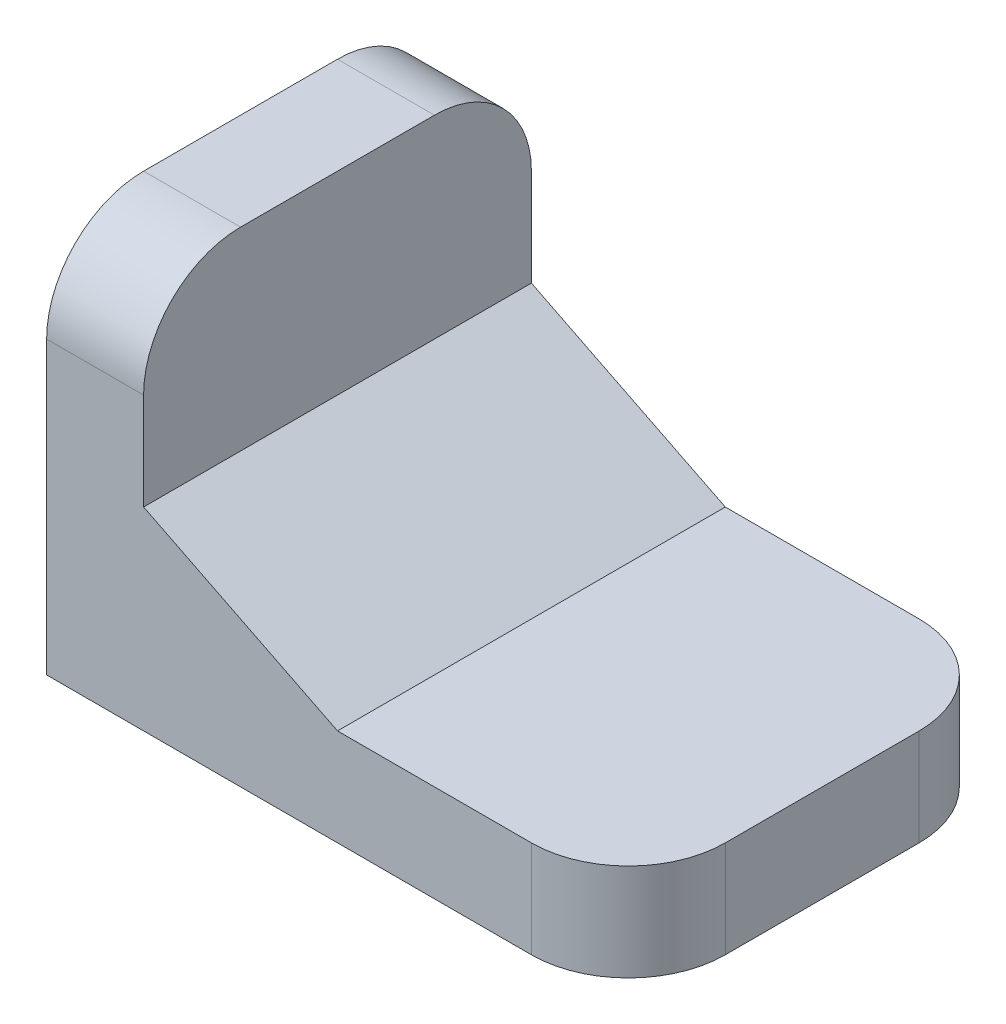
from build123d import *

# Parameters (mm, degrees)
EXTRUDE1_DEPTH = 20
FILLET1_R      = 10


with BuildPart() as part:
    # Sketch1 → Extrude1 (new, symmetric)
    with BuildSketch(Plane.XY):
        Polygon((0, 0), (0, 40), (10, 40), (10, 20), (30, 10), (60, 10), (60, 0), align=None)
    extrude(amount=EXTRUDE1_DEPTH, both=True)

    # Fillet1
    fillet1_edges = [part.edges().sort_by_distance(p)[0] for p in [
        (5, 40, 20),
        (60, 5, 20),
        (5, 40, -20),
        (60, 5, -20),
    ]]
    fillet(fillet1_edges, radius=FILLET1_R)


solid = part.part
